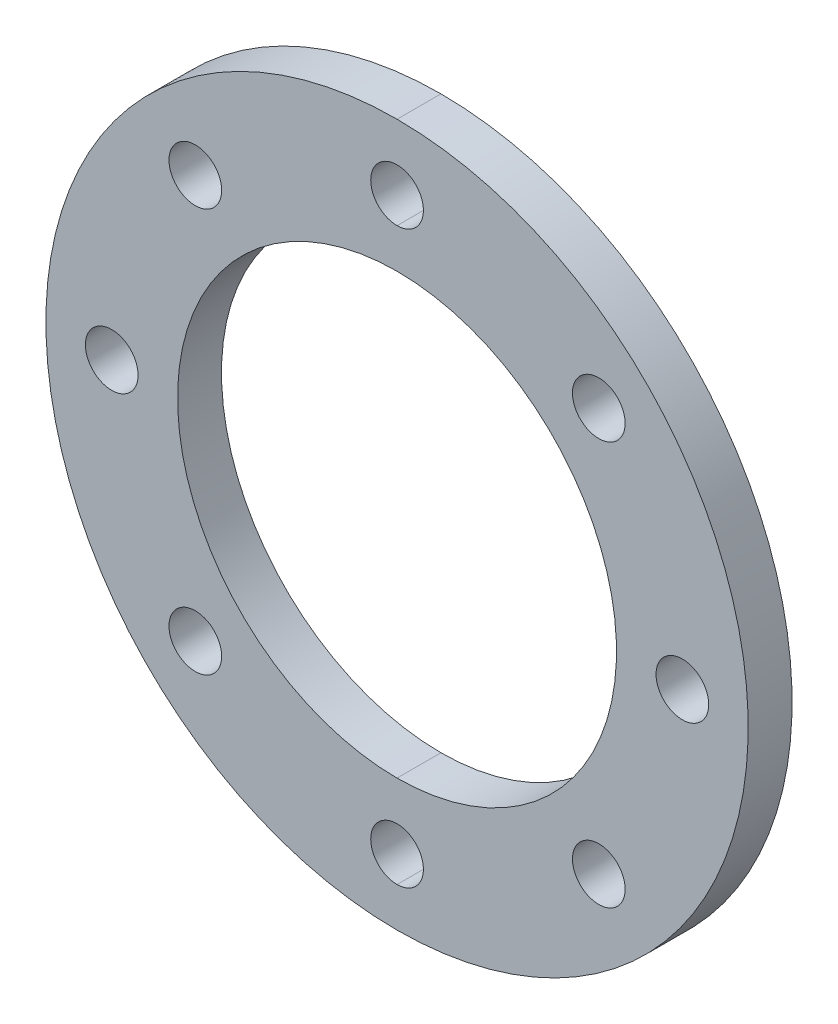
ISO-10303-21;
HEADER;
FILE_DESCRIPTION(('STEP AP214'),'2;1');
FILE_NAME('part.step','',(''),(''),'','','');
FILE_SCHEMA(('AUTOMOTIVE_DESIGN { 1 0 10303 214 1 1 1 1 }'));
ENDSEC;
DATA;
#1=APPLICATION_CONTEXT('core data for automotive mechanical design processes');
#2=APPLICATION_PROTOCOL_DEFINITION('international standard','automotive_design',2000,#1);
#3=PRODUCT_CONTEXT('',#1,'mechanical');
#4=PRODUCT('Part','Part','',(#3));
#5=PRODUCT_RELATED_PRODUCT_CATEGORY('part','',(#4));
#6=PRODUCT_DEFINITION_FORMATION('','',#4);
#7=PRODUCT_DEFINITION_CONTEXT('part definition',#1,'design');
#8=PRODUCT_DEFINITION('design','',#6,#7);
#9=PRODUCT_DEFINITION_SHAPE('','',#8);
#10=(LENGTH_UNIT() NAMED_UNIT(*) SI_UNIT(.MILLI.,.METRE.));
#11=(NAMED_UNIT(*) PLANE_ANGLE_UNIT() SI_UNIT($,.RADIAN.));
#12=(NAMED_UNIT(*) SI_UNIT($,.STERADIAN.) SOLID_ANGLE_UNIT());
#13=UNCERTAINTY_MEASURE_WITH_UNIT(LENGTH_MEASURE(1.E-05),#10,'distance_accuracy_value','');
#14=(GEOMETRIC_REPRESENTATION_CONTEXT(3) GLOBAL_UNCERTAINTY_ASSIGNED_CONTEXT((#13)) GLOBAL_UNIT_ASSIGNED_CONTEXT((#10,
#11,#12)) REPRESENTATION_CONTEXT('',''));
#15=CARTESIAN_POINT('',(0.,0.,0.));
#16=DIRECTION('',(0.,0.,1.));
#17=DIRECTION('',(1.,0.,0.));
#18=AXIS2_PLACEMENT_3D('',#15,#16,#17);
#19=CARTESIAN_POINT('',(3.40419627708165E-13,32.5,0.));
#20=DIRECTION('',(0.,0.,1.));
#21=DIRECTION('',(1.,0.,0.));
#22=AXIS2_PLACEMENT_3D('',#19,#20,#21);
#23=CYLINDRICAL_SURFACE('',#22,3.);
#24=DIRECTION('',(0.,0.,1.));
#25=VECTOR('',#24,1.);
#26=CARTESIAN_POINT('',(0.,35.5,0.));
#27=LINE('',#26,#25);
#28=CARTESIAN_POINT('',(3.71842977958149E-13,35.5,5.));
#29=VERTEX_POINT('',#28);
#30=CARTESIAN_POINT('',(3.71842977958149E-13,35.5,0.));
#31=VERTEX_POINT('',#30);
#32=EDGE_CURVE('E11',#29,#31,#27,.F.);
#33=ORIENTED_EDGE('',*,*,#32,.F.);
#34=CARTESIAN_POINT('',(3.40419627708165E-13,32.5,5.));
#35=DIRECTION('',(0.,0.,1.));
#36=DIRECTION('',(0.,1.,0.));
#37=AXIS2_PLACEMENT_3D('',#34,#35,#36);
#38=CIRCLE('',#37,3.);
#39=CARTESIAN_POINT('',(0.,29.5,5.));
#40=VERTEX_POINT('',#39);
#41=EDGE_CURVE('E197',#29,#40,#38,.T.);
#42=ORIENTED_EDGE('',*,*,#41,.T.);
#43=DIRECTION('',(0.,0.,1.));
#44=VECTOR('',#43,1.);
#45=CARTESIAN_POINT('',(0.,29.5,0.));
#46=LINE('',#45,#44);
#47=CARTESIAN_POINT('',(0.,29.5,0.));
#48=VERTEX_POINT('',#47);
#49=EDGE_CURVE('E44',#48,#40,#46,.T.);
#50=ORIENTED_EDGE('',*,*,#49,.F.);
#51=CARTESIAN_POINT('',(3.40419627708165E-13,32.5,0.));
#52=DIRECTION('',(0.,0.,1.));
#53=DIRECTION('',(0.,1.,0.));
#54=AXIS2_PLACEMENT_3D('',#51,#52,#53);
#55=CIRCLE('',#54,3.);
#56=EDGE_CURVE('E194',#31,#48,#55,.T.);
#57=ORIENTED_EDGE('',*,*,#56,.F.);
#58=EDGE_LOOP('',(#33,#42,#50,#57));
#59=FACE_BOUND('',#58,.T.);
#60=ADVANCED_FACE('F34',(#59),#23,.F.);
#61=CARTESIAN_POINT('',(-1.13473209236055E-13,-32.5,0.));
#62=DIRECTION('',(0.,0.,1.));
#63=DIRECTION('',(1.,0.,0.));
#64=AXIS2_PLACEMENT_3D('',#61,#62,#63);
#65=CYLINDRICAL_SURFACE('',#64,3.);
#66=DIRECTION('',(0.,0.,1.));
#67=VECTOR('',#66,1.);
#68=CARTESIAN_POINT('',(0.,-29.5,0.));
#69=LINE('',#68,#67);
#70=CARTESIAN_POINT('',(0.,-29.5,5.));
#71=VERTEX_POINT('',#70);
#72=CARTESIAN_POINT('',(0.,-29.5,0.));
#73=VERTEX_POINT('',#72);
#74=EDGE_CURVE('E128',#71,#73,#69,.F.);
#75=ORIENTED_EDGE('',*,*,#74,.F.);
#76=CARTESIAN_POINT('',(-1.13473209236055E-13,-32.5,5.));
#77=DIRECTION('',(0.,0.,1.));
#78=DIRECTION('',(0.,-1.,0.));
#79=AXIS2_PLACEMENT_3D('',#76,#77,#78);
#80=CIRCLE('',#79,3.);
#81=CARTESIAN_POINT('',(-1.23947659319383E-13,-35.5,5.));
#82=VERTEX_POINT('',#81);
#83=EDGE_CURVE('E175',#71,#82,#80,.T.);
#84=ORIENTED_EDGE('',*,*,#83,.T.);
#85=DIRECTION('',(0.,0.,1.));
#86=VECTOR('',#85,1.);
#87=CARTESIAN_POINT('',(0.,-35.5,0.));
#88=LINE('',#87,#86);
#89=CARTESIAN_POINT('',(-1.23947659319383E-13,-35.5,0.));
#90=VERTEX_POINT('',#89);
#91=EDGE_CURVE('E131',#90,#82,#88,.T.);
#92=ORIENTED_EDGE('',*,*,#91,.F.);
#93=CARTESIAN_POINT('',(-1.13473209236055E-13,-32.5,0.));
#94=DIRECTION('',(0.,0.,1.));
#95=DIRECTION('',(0.,-1.,0.));
#96=AXIS2_PLACEMENT_3D('',#93,#94,#95);
#97=CIRCLE('',#96,3.);
#98=EDGE_CURVE('E174',#73,#90,#97,.T.);
#99=ORIENTED_EDGE('',*,*,#98,.F.);
#100=EDGE_LOOP('',(#75,#84,#92,#99));
#101=FACE_BOUND('',#100,.T.);
#102=ADVANCED_FACE('F249',(#101),#65,.F.);
#103=CARTESIAN_POINT('',(0.,0.,0.));
#104=DIRECTION('',(0.,0.,1.));
#105=DIRECTION('',(1.,0.,0.));
#106=AXIS2_PLACEMENT_3D('',#103,#104,#105);
#107=CYLINDRICAL_SURFACE('',#106,25.);
#108=DIRECTION('',(0.,0.,1.));
#109=VECTOR('',#108,1.);
#110=CARTESIAN_POINT('',(0.,25.,0.));
#111=LINE('',#110,#109);
#112=CARTESIAN_POINT('',(0.,25.,5.));
#113=VERTEX_POINT('',#112);
#114=CARTESIAN_POINT('',(0.,25.,0.));
#115=VERTEX_POINT('',#114);
#116=EDGE_CURVE('E133',#113,#115,#111,.F.);
#117=ORIENTED_EDGE('',*,*,#116,.F.);
#118=CARTESIAN_POINT('',(0.,0.,5.));
#119=DIRECTION('',(0.,0.,1.));
#120=DIRECTION('',(1.,0.,0.));
#121=AXIS2_PLACEMENT_3D('',#118,#119,#120);
#122=CIRCLE('',#121,25.);
#123=CARTESIAN_POINT('',(0.,-25.,5.));
#124=VERTEX_POINT('',#123);
#125=EDGE_CURVE('E121',#113,#124,#122,.T.);
#126=ORIENTED_EDGE('',*,*,#125,.T.);
#127=DIRECTION('',(0.,0.,1.));
#128=VECTOR('',#127,1.);
#129=CARTESIAN_POINT('',(0.,-25.,0.));
#130=LINE('',#129,#128);
#131=CARTESIAN_POINT('',(0.,-25.,0.));
#132=VERTEX_POINT('',#131);
#133=EDGE_CURVE('E38',#132,#124,#130,.T.);
#134=ORIENTED_EDGE('',*,*,#133,.F.);
#135=CARTESIAN_POINT('',(0.,0.,0.));
#136=DIRECTION('',(0.,0.,1.));
#137=DIRECTION('',(1.,0.,0.));
#138=AXIS2_PLACEMENT_3D('',#135,#136,#137);
#139=CIRCLE('',#138,25.);
#140=EDGE_CURVE('E156',#115,#132,#139,.T.);
#141=ORIENTED_EDGE('',*,*,#140,.F.);
#142=EDGE_LOOP('',(#117,#126,#134,#141));
#143=FACE_BOUND('',#142,.T.);
#144=ADVANCED_FACE('F155',(#143),#107,.F.);
#145=CARTESIAN_POINT('',(0.,0.,5.));
#146=DIRECTION('',(0.,0.,-1.));
#147=DIRECTION('',(-1.,0.,0.));
#148=AXIS2_PLACEMENT_3D('',#145,#146,#147);
#149=CYLINDRICAL_SURFACE('',#148,40.);
#150=DIRECTION('',(0.,0.,-1.));
#151=VECTOR('',#150,1.);
#152=CARTESIAN_POINT('',(0.,-40.,5.));
#153=LINE('',#152,#151);
#154=CARTESIAN_POINT('',(0.,-40.,5.));
#155=VERTEX_POINT('',#154);
#156=CARTESIAN_POINT('',(0.,-40.,0.));
#157=VERTEX_POINT('',#156);
#158=EDGE_CURVE('E111',#155,#157,#153,.T.);
#159=ORIENTED_EDGE('',*,*,#158,.F.);
#160=CARTESIAN_POINT('',(0.,0.,5.));
#161=DIRECTION('',(0.,0.,1.));
#162=DIRECTION('',(1.,0.,0.));
#163=AXIS2_PLACEMENT_3D('',#160,#161,#162);
#164=CIRCLE('',#163,40.);
#165=CARTESIAN_POINT('',(0.,40.,5.));
#166=VERTEX_POINT('',#165);
#167=EDGE_CURVE('E112',#166,#155,#164,.T.);
#168=ORIENTED_EDGE('',*,*,#167,.F.);
#169=DIRECTION('',(0.,0.,-1.));
#170=VECTOR('',#169,1.);
#171=CARTESIAN_POINT('',(0.,40.,5.));
#172=LINE('',#171,#170);
#173=CARTESIAN_POINT('',(0.,40.,0.));
#174=VERTEX_POINT('',#173);
#175=EDGE_CURVE('E100',#174,#166,#172,.F.);
#176=ORIENTED_EDGE('',*,*,#175,.F.);
#177=CARTESIAN_POINT('',(0.,0.,0.));
#178=DIRECTION('',(0.,0.,1.));
#179=DIRECTION('',(1.,0.,0.));
#180=AXIS2_PLACEMENT_3D('',#177,#178,#179);
#181=CIRCLE('',#180,40.);
#182=EDGE_CURVE('E116',#174,#157,#181,.T.);
#183=ORIENTED_EDGE('',*,*,#182,.T.);
#184=EDGE_LOOP('',(#159,#168,#176,#183));
#185=FACE_BOUND('',#184,.T.);
#186=ADVANCED_FACE('F118',(#185),#149,.T.);
#187=EDGE_CURVE('E102',#155,#166,#164,.T.);
#188=ORIENTED_EDGE('',*,*,#187,.F.);
#189=ORIENTED_EDGE('',*,*,#158,.T.);
#190=EDGE_CURVE('E105',#157,#174,#181,.T.);
#191=ORIENTED_EDGE('',*,*,#190,.T.);
#192=ORIENTED_EDGE('',*,*,#175,.T.);
#193=EDGE_LOOP('',(#188,#189,#191,#192));
#194=FACE_BOUND('',#193,.T.);
#195=ADVANCED_FACE('F36',(#194),#149,.T.);
#196=CARTESIAN_POINT('',(0.,0.,5.));
#197=DIRECTION('',(0.,0.,1.));
#198=DIRECTION('',(1.,0.,0.));
#199=AXIS2_PLACEMENT_3D('',#196,#197,#198);
#200=PLANE('',#199);
#201=CARTESIAN_POINT('',(22.9809703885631,22.9809703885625,5.));
#202=DIRECTION('',(0.,0.,1.));
#203=DIRECTION('',(0.707106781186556,0.707106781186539,0.));
#204=AXIS2_PLACEMENT_3D('',#201,#202,#203);
#205=CIRCLE('',#204,3.);
#206=CARTESIAN_POINT('',(25.1022907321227,25.1022907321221,5.));
#207=VERTEX_POINT('',#206);
#208=EDGE_CURVE('E203',#207,#207,#205,.T.);
#209=ORIENTED_EDGE('',*,*,#208,.F.);
#210=EDGE_LOOP('',(#209));
#211=FACE_BOUND('',#210,.T.);
#212=ORIENTED_EDGE('',*,*,#41,.F.);
#213=EDGE_CURVE('E200',#40,#29,#38,.T.);
#214=ORIENTED_EDGE('',*,*,#213,.F.);
#215=EDGE_LOOP('',(#212,#214));
#216=FACE_BOUND('',#215,.T.);
#217=CARTESIAN_POINT('',(-22.9809703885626,22.980970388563,5.));
#218=DIRECTION('',(0.,0.,1.));
#219=DIRECTION('',(-0.707106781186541,0.707106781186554,0.));
#220=AXIS2_PLACEMENT_3D('',#217,#218,#219);
#221=CIRCLE('',#220,3.);
#222=CARTESIAN_POINT('',(-25.1022907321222,25.1022907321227,5.));
#223=VERTEX_POINT('',#222);
#224=EDGE_CURVE('E191',#223,#223,#221,.T.);
#225=ORIENTED_EDGE('',*,*,#224,.F.);
#226=EDGE_LOOP('',(#225));
#227=FACE_BOUND('',#226,.T.);
#228=CARTESIAN_POINT('',(-32.5,2.2694641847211E-13,5.));
#229=DIRECTION('',(0.,0.,1.));
#230=DIRECTION('',(-1.,0.,0.));
#231=AXIS2_PLACEMENT_3D('',#228,#229,#230);
#232=CIRCLE('',#231,3.);
#233=CARTESIAN_POINT('',(-35.5,2.47895318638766E-13,5.));
#234=VERTEX_POINT('',#233);
#235=EDGE_CURVE('E185',#234,#234,#232,.T.);
#236=ORIENTED_EDGE('',*,*,#235,.F.);
#237=EDGE_LOOP('',(#236));
#238=FACE_BOUND('',#237,.T.);
#239=CARTESIAN_POINT('',(-22.9809703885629,-22.9809703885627,5.));
#240=DIRECTION('',(0.,0.,1.));
#241=DIRECTION('',(-0.707106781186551,-0.707106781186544,0.));
#242=AXIS2_PLACEMENT_3D('',#239,#240,#241);
#243=CIRCLE('',#242,3.);
#244=CARTESIAN_POINT('',(-25.1022907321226,-25.1022907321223,5.));
#245=VERTEX_POINT('',#244);
#246=EDGE_CURVE('E178',#245,#245,#243,.T.);
#247=ORIENTED_EDGE('',*,*,#246,.F.);
#248=EDGE_LOOP('',(#247));
#249=FACE_BOUND('',#248,.T.);
#250=EDGE_CURVE('E171',#82,#71,#80,.T.);
#251=ORIENTED_EDGE('',*,*,#250,.F.);
#252=ORIENTED_EDGE('',*,*,#83,.F.);
#253=EDGE_LOOP('',(#251,#252));
#254=FACE_BOUND('',#253,.T.);
#255=CARTESIAN_POINT('',(22.9809703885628,-22.9809703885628,5.));
#256=DIRECTION('',(0.,0.,1.));
#257=DIRECTION('',(0.707106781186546,-0.707106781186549,0.));
#258=AXIS2_PLACEMENT_3D('',#255,#256,#257);
#259=CIRCLE('',#258,3.);
#260=CARTESIAN_POINT('',(25.1022907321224,-25.1022907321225,5.));
#261=VERTEX_POINT('',#260);
#262=EDGE_CURVE('E165',#261,#261,#259,.T.);
#263=ORIENTED_EDGE('',*,*,#262,.F.);
#264=EDGE_LOOP('',(#263));
#265=FACE_BOUND('',#264,.T.);
#266=CARTESIAN_POINT('',(32.5,0.,5.));
#267=DIRECTION('',(0.,0.,1.));
#268=DIRECTION('',(1.,0.,0.));
#269=AXIS2_PLACEMENT_3D('',#266,#267,#268);
#270=CIRCLE('',#269,3.);
#271=CARTESIAN_POINT('',(35.5,0.,5.));
#272=VERTEX_POINT('',#271);
#273=EDGE_CURVE('E159',#272,#272,#270,.T.);
#274=ORIENTED_EDGE('',*,*,#273,.F.);
#275=EDGE_LOOP('',(#274));
#276=FACE_BOUND('',#275,.T.);
#277=ORIENTED_EDGE('',*,*,#125,.F.);
#278=EDGE_CURVE('E146',#124,#113,#122,.T.);
#279=ORIENTED_EDGE('',*,*,#278,.F.);
#280=EDGE_LOOP('',(#277,#279));
#281=FACE_BOUND('',#280,.T.);
#282=ORIENTED_EDGE('',*,*,#167,.T.);
#283=ORIENTED_EDGE('',*,*,#187,.T.);
#284=EDGE_LOOP('',(#282,#283));
#285=FACE_BOUND('',#284,.T.);
#286=ADVANCED_FACE('F115',(#211,#216,#227,#238,#249,#254,#265,#276,#281,#285),#200,.T.);
#287=CARTESIAN_POINT('',(0.,0.,0.));
#288=DIRECTION('',(0.,0.,1.));
#289=DIRECTION('',(1.,0.,0.));
#290=AXIS2_PLACEMENT_3D('',#287,#288,#289);
#291=PLANE('',#290);
#292=CARTESIAN_POINT('',(22.9809703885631,22.9809703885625,0.));
#293=DIRECTION('',(0.,0.,1.));
#294=DIRECTION('',(0.707106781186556,0.707106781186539,0.));
#295=AXIS2_PLACEMENT_3D('',#292,#293,#294);
#296=CIRCLE('',#295,3.);
#297=CARTESIAN_POINT('',(25.1022907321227,25.1022907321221,0.));
#298=VERTEX_POINT('',#297);
#299=EDGE_CURVE('E206',#298,#298,#296,.T.);
#300=ORIENTED_EDGE('',*,*,#299,.T.);
#301=EDGE_LOOP('',(#300));
#302=FACE_BOUND('',#301,.T.);
#303=ORIENTED_EDGE('',*,*,#56,.T.);
#304=EDGE_CURVE('E199',#48,#31,#55,.T.);
#305=ORIENTED_EDGE('',*,*,#304,.T.);
#306=EDGE_LOOP('',(#303,#305));
#307=FACE_BOUND('',#306,.T.);
#308=CARTESIAN_POINT('',(-22.9809703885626,22.980970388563,0.));
#309=DIRECTION('',(0.,0.,1.));
#310=DIRECTION('',(-0.707106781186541,0.707106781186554,0.));
#311=AXIS2_PLACEMENT_3D('',#308,#309,#310);
#312=CIRCLE('',#311,3.);
#313=CARTESIAN_POINT('',(-25.1022907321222,25.1022907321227,0.));
#314=VERTEX_POINT('',#313);
#315=EDGE_CURVE('E188',#314,#314,#312,.T.);
#316=ORIENTED_EDGE('',*,*,#315,.T.);
#317=EDGE_LOOP('',(#316));
#318=FACE_BOUND('',#317,.T.);
#319=CARTESIAN_POINT('',(-32.5,2.2694641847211E-13,0.));
#320=DIRECTION('',(0.,0.,1.));
#321=DIRECTION('',(-1.,0.,0.));
#322=AXIS2_PLACEMENT_3D('',#319,#320,#321);
#323=CIRCLE('',#322,3.);
#324=CARTESIAN_POINT('',(-35.5,2.47895318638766E-13,0.));
#325=VERTEX_POINT('',#324);
#326=EDGE_CURVE('E182',#325,#325,#323,.T.);
#327=ORIENTED_EDGE('',*,*,#326,.T.);
#328=EDGE_LOOP('',(#327));
#329=FACE_BOUND('',#328,.T.);
#330=CARTESIAN_POINT('',(-22.9809703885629,-22.9809703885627,0.));
#331=DIRECTION('',(0.,0.,1.));
#332=DIRECTION('',(-0.707106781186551,-0.707106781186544,0.));
#333=AXIS2_PLACEMENT_3D('',#330,#331,#332);
#334=CIRCLE('',#333,3.);
#335=CARTESIAN_POINT('',(-25.1022907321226,-25.1022907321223,0.));
#336=VERTEX_POINT('',#335);
#337=EDGE_CURVE('E181',#336,#336,#334,.T.);
#338=ORIENTED_EDGE('',*,*,#337,.T.);
#339=EDGE_LOOP('',(#338));
#340=FACE_BOUND('',#339,.T.);
#341=EDGE_CURVE('E168',#90,#73,#97,.T.);
#342=ORIENTED_EDGE('',*,*,#341,.T.);
#343=ORIENTED_EDGE('',*,*,#98,.T.);
#344=EDGE_LOOP('',(#342,#343));
#345=FACE_BOUND('',#344,.T.);
#346=CARTESIAN_POINT('',(22.9809703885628,-22.9809703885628,0.));
#347=DIRECTION('',(0.,0.,1.));
#348=DIRECTION('',(0.707106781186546,-0.707106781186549,0.));
#349=AXIS2_PLACEMENT_3D('',#346,#347,#348);
#350=CIRCLE('',#349,3.);
#351=CARTESIAN_POINT('',(25.1022907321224,-25.1022907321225,0.));
#352=VERTEX_POINT('',#351);
#353=EDGE_CURVE('E162',#352,#352,#350,.T.);
#354=ORIENTED_EDGE('',*,*,#353,.T.);
#355=EDGE_LOOP('',(#354));
#356=FACE_BOUND('',#355,.T.);
#357=CARTESIAN_POINT('',(32.5,0.,0.));
#358=DIRECTION('',(0.,0.,1.));
#359=DIRECTION('',(1.,0.,0.));
#360=AXIS2_PLACEMENT_3D('',#357,#358,#359);
#361=CIRCLE('',#360,3.);
#362=CARTESIAN_POINT('',(35.5,0.,0.));
#363=VERTEX_POINT('',#362);
#364=EDGE_CURVE('E154',#363,#363,#361,.T.);
#365=ORIENTED_EDGE('',*,*,#364,.T.);
#366=EDGE_LOOP('',(#365));
#367=FACE_BOUND('',#366,.T.);
#368=ORIENTED_EDGE('',*,*,#140,.T.);
#369=EDGE_CURVE('E148',#132,#115,#139,.T.);
#370=ORIENTED_EDGE('',*,*,#369,.T.);
#371=EDGE_LOOP('',(#368,#370));
#372=FACE_BOUND('',#371,.T.);
#373=ORIENTED_EDGE('',*,*,#182,.F.);
#374=ORIENTED_EDGE('',*,*,#190,.F.);
#375=EDGE_LOOP('',(#373,#374));
#376=FACE_BOUND('',#375,.T.);
#377=ADVANCED_FACE('F216',(#302,#307,#318,#329,#340,#345,#356,#367,#372,#376),#291,.F.);
#378=ORIENTED_EDGE('',*,*,#278,.T.);
#379=ORIENTED_EDGE('',*,*,#116,.T.);
#380=ORIENTED_EDGE('',*,*,#369,.F.);
#381=ORIENTED_EDGE('',*,*,#133,.T.);
#382=EDGE_LOOP('',(#378,#379,#380,#381));
#383=FACE_BOUND('',#382,.T.);
#384=ADVANCED_FACE('F145',(#383),#107,.F.);
#385=CARTESIAN_POINT('',(32.5,0.,0.));
#386=DIRECTION('',(0.,0.,1.));
#387=DIRECTION('',(1.,0.,0.));
#388=AXIS2_PLACEMENT_3D('',#385,#386,#387);
#389=CYLINDRICAL_SURFACE('',#388,3.);
#390=ORIENTED_EDGE('',*,*,#364,.F.);
#391=EDGE_LOOP('',(#390));
#392=FACE_BOUND('',#391,.T.);
#393=ORIENTED_EDGE('',*,*,#273,.T.);
#394=EDGE_LOOP('',(#393));
#395=FACE_BOUND('',#394,.T.);
#396=ADVANCED_FACE('F233',(#392,#395),#389,.F.);
#397=CARTESIAN_POINT('',(22.9809703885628,-22.9809703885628,0.));
#398=DIRECTION('',(0.,0.,1.));
#399=DIRECTION('',(1.,0.,0.));
#400=AXIS2_PLACEMENT_3D('',#397,#398,#399);
#401=CYLINDRICAL_SURFACE('',#400,3.);
#402=ORIENTED_EDGE('',*,*,#353,.F.);
#403=EDGE_LOOP('',(#402));
#404=FACE_BOUND('',#403,.T.);
#405=ORIENTED_EDGE('',*,*,#262,.T.);
#406=EDGE_LOOP('',(#405));
#407=FACE_BOUND('',#406,.T.);
#408=ADVANCED_FACE('F236',(#404,#407),#401,.F.);
#409=ORIENTED_EDGE('',*,*,#250,.T.);
#410=ORIENTED_EDGE('',*,*,#74,.T.);
#411=ORIENTED_EDGE('',*,*,#341,.F.);
#412=ORIENTED_EDGE('',*,*,#91,.T.);
#413=EDGE_LOOP('',(#409,#410,#411,#412));
#414=FACE_BOUND('',#413,.T.);
#415=ADVANCED_FACE('F256',(#414),#65,.F.);
#416=CARTESIAN_POINT('',(-22.9809703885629,-22.9809703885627,0.));
#417=DIRECTION('',(0.,0.,1.));
#418=DIRECTION('',(1.,0.,0.));
#419=AXIS2_PLACEMENT_3D('',#416,#417,#418);
#420=CYLINDRICAL_SURFACE('',#419,3.);
#421=ORIENTED_EDGE('',*,*,#337,.F.);
#422=EDGE_LOOP('',(#421));
#423=FACE_BOUND('',#422,.T.);
#424=ORIENTED_EDGE('',*,*,#246,.T.);
#425=EDGE_LOOP('',(#424));
#426=FACE_BOUND('',#425,.T.);
#427=ADVANCED_FACE('F272',(#423,#426),#420,.F.);
#428=CARTESIAN_POINT('',(-32.5,2.2694641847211E-13,0.));
#429=DIRECTION('',(0.,0.,1.));
#430=DIRECTION('',(1.,0.,0.));
#431=AXIS2_PLACEMENT_3D('',#428,#429,#430);
#432=CYLINDRICAL_SURFACE('',#431,3.);
#433=ORIENTED_EDGE('',*,*,#326,.F.);
#434=EDGE_LOOP('',(#433));
#435=FACE_BOUND('',#434,.T.);
#436=ORIENTED_EDGE('',*,*,#235,.T.);
#437=EDGE_LOOP('',(#436));
#438=FACE_BOUND('',#437,.T.);
#439=ADVANCED_FACE('F267',(#435,#438),#432,.F.);
#440=CARTESIAN_POINT('',(-22.9809703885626,22.980970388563,0.));
#441=DIRECTION('',(0.,0.,1.));
#442=DIRECTION('',(1.,0.,0.));
#443=AXIS2_PLACEMENT_3D('',#440,#441,#442);
#444=CYLINDRICAL_SURFACE('',#443,3.);
#445=ORIENTED_EDGE('',*,*,#315,.F.);
#446=EDGE_LOOP('',(#445));
#447=FACE_BOUND('',#446,.T.);
#448=ORIENTED_EDGE('',*,*,#224,.T.);
#449=EDGE_LOOP('',(#448));
#450=FACE_BOUND('',#449,.T.);
#451=ADVANCED_FACE('F261',(#447,#450),#444,.F.);
#452=ORIENTED_EDGE('',*,*,#213,.T.);
#453=ORIENTED_EDGE('',*,*,#32,.T.);
#454=ORIENTED_EDGE('',*,*,#304,.F.);
#455=ORIENTED_EDGE('',*,*,#49,.T.);
#456=EDGE_LOOP('',(#452,#453,#454,#455));
#457=FACE_BOUND('',#456,.T.);
#458=ADVANCED_FACE('F211',(#457),#23,.F.);
#459=CARTESIAN_POINT('',(22.9809703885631,22.9809703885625,0.));
#460=DIRECTION('',(0.,0.,1.));
#461=DIRECTION('',(1.,0.,0.));
#462=AXIS2_PLACEMENT_3D('',#459,#460,#461);
#463=CYLINDRICAL_SURFACE('',#462,3.);
#464=ORIENTED_EDGE('',*,*,#299,.F.);
#465=EDGE_LOOP('',(#464));
#466=FACE_BOUND('',#465,.T.);
#467=ORIENTED_EDGE('',*,*,#208,.T.);
#468=EDGE_LOOP('',(#467));
#469=FACE_BOUND('',#468,.T.);
#470=ADVANCED_FACE('F260',(#466,#469),#463,.F.);
#471=CLOSED_SHELL('',(#60,#102,#144,#186,#195,#286,#377,#384,#396,#408,#415,#427,#439,#451,#458,#470));
#472=MANIFOLD_SOLID_BREP('B2',#471);
#473=ADVANCED_BREP_SHAPE_REPRESENTATION('',(#18,#472),#14);
#474=SHAPE_DEFINITION_REPRESENTATION(#9,#473);
ENDSEC;
END-ISO-10303-21;
